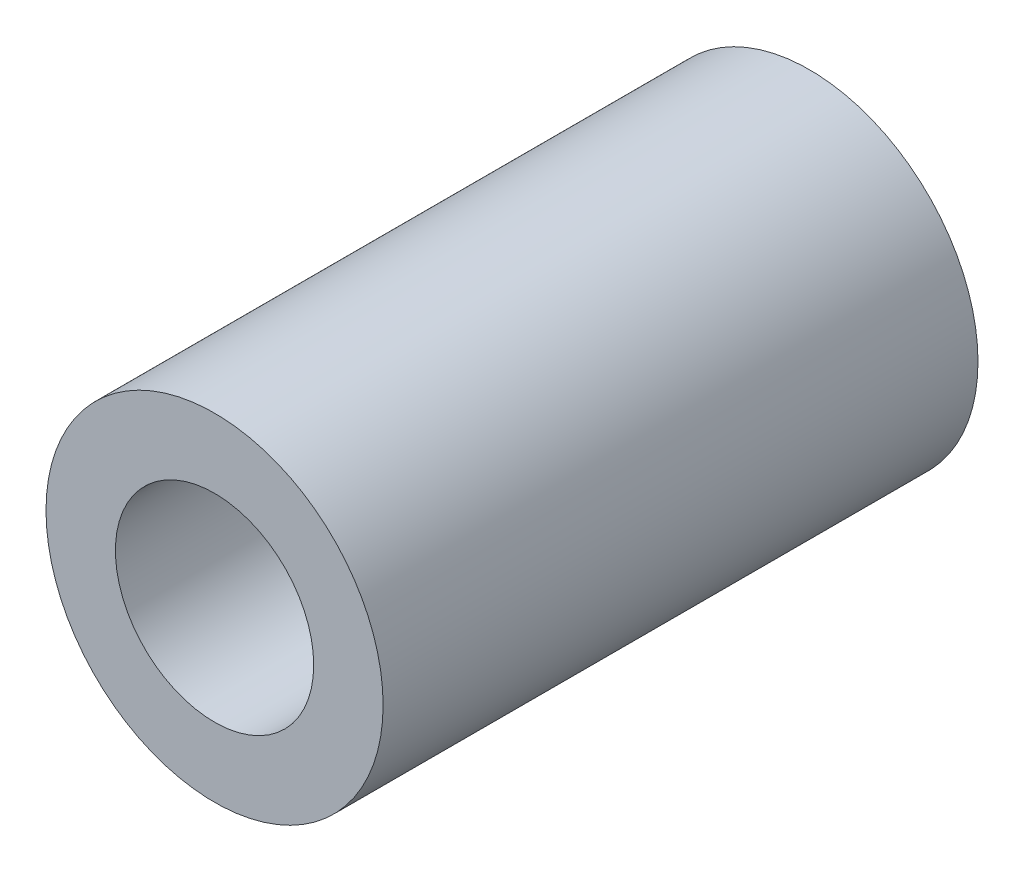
from build123d import *

# Parameters (mm, degrees)
ESQUISSE1_R      = 8.5
ESQUISSE1_R_2    = 5
EXTRUSION1_DEPTH = 30


with BuildPart() as part:
    # Esquisse1 → Extrusion1 (new body)
    with BuildSketch(Plane.XY):
        Circle(ESQUISSE1_R)
        Circle(ESQUISSE1_R_2, mode=Mode.SUBTRACT)
    extrude(amount=EXTRUSION1_DEPTH)


solid = part.part
